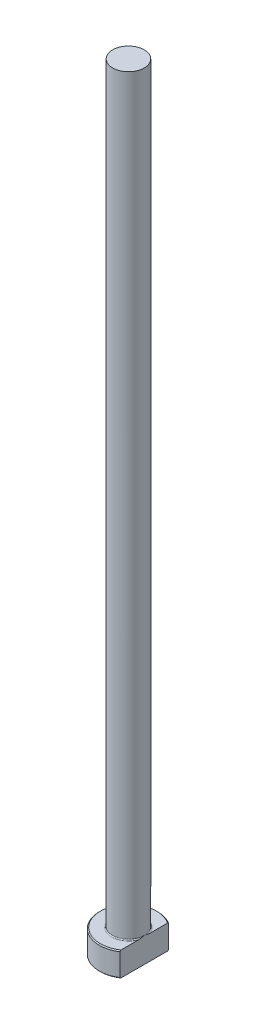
from build123d import *
from build123d.topology import SkipClean

# Parameters (mm, degrees)
CHAMFER1_SIZE = 0.2
FILLET1_R     = 0.2
KEY_DEPTH     = 161.224842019


with BuildPart() as part:
    # Sketch1 → Revolve1 (revolve)
    with BuildSketch(Plane.XY, mode=Mode.PRIVATE) as revolve1_sk:
        Polygon((0, 0), (-6, 0), (-6, 5), (-3.25, 5), (-3.25, 160), (0, 160), align=None)
    revolve(revolve1_sk.sketch.rotate(Axis((0, 259.958771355, 0), (0, -1, 0)), 270), axis=Axis((0, 259.958771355, 0), (0, -1, 0)))

    # Chamfer1
    chamfer1_edges = [part.edges().sort_by_distance(p)[0] for p in [
        (0, 5, -6),
        (0, 0, -6),
    ]]
    chamfer(chamfer1_edges, length=CHAMFER1_SIZE)

    # Fillet1
    fillet1_edges = [part.edges().sort_by_distance(p)[0] for p in [
        (0, 5, -3.25),
    ]]
    fillet(fillet1_edges, radius=FILLET1_R)

    # Sketch2 → KEY (cut, through all)
    with SkipClean():  # the faces are left unmerged after this step: merging them gives an invalid solid
        with BuildSketch(Plane(origin=(0, 0, 0), x_dir=(1, 0, 0), z_dir=(0, 1, 0))):
            with BuildLine():
                Line((3.25, 5.04356025), (3.25, -5.04356025))
                ThreePointArc((3.25, -5.04356025), (6, 0), (3.25, 5.04356025))
            make_face()
        extrude(amount=KEY_DEPTH, mode=Mode.SUBTRACT)


solid = part.part
